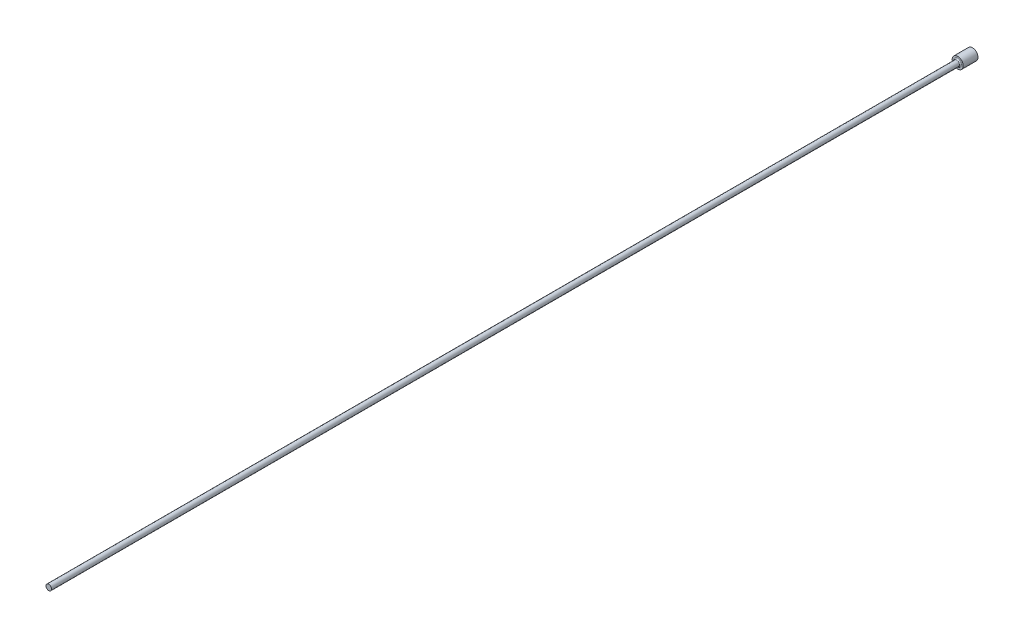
ISO-10303-21;
HEADER;
FILE_DESCRIPTION(('STEP AP214'),'2;1');
FILE_NAME('part.step','',(''),(''),'','','');
FILE_SCHEMA(('AUTOMOTIVE_DESIGN { 1 0 10303 214 1 1 1 1 }'));
ENDSEC;
DATA;
#1=APPLICATION_CONTEXT('core data for automotive mechanical design processes');
#2=APPLICATION_PROTOCOL_DEFINITION('international standard','automotive_design',2000,#1);
#3=PRODUCT_CONTEXT('',#1,'mechanical');
#4=PRODUCT('Part','Part','',(#3));
#5=PRODUCT_RELATED_PRODUCT_CATEGORY('part','',(#4));
#6=PRODUCT_DEFINITION_FORMATION('','',#4);
#7=PRODUCT_DEFINITION_CONTEXT('part definition',#1,'design');
#8=PRODUCT_DEFINITION('design','',#6,#7);
#9=PRODUCT_DEFINITION_SHAPE('','',#8);
#10=(LENGTH_UNIT() NAMED_UNIT(*) SI_UNIT(.MILLI.,.METRE.));
#11=(NAMED_UNIT(*) PLANE_ANGLE_UNIT() SI_UNIT($,.RADIAN.));
#12=(NAMED_UNIT(*) SI_UNIT($,.STERADIAN.) SOLID_ANGLE_UNIT());
#13=UNCERTAINTY_MEASURE_WITH_UNIT(LENGTH_MEASURE(1.E-05),#10,'distance_accuracy_value','');
#14=(GEOMETRIC_REPRESENTATION_CONTEXT(3) GLOBAL_UNCERTAINTY_ASSIGNED_CONTEXT((#13)) GLOBAL_UNIT_ASSIGNED_CONTEXT((#10,
#11,#12)) REPRESENTATION_CONTEXT('',''));
#15=CARTESIAN_POINT('',(0.,0.,0.));
#16=DIRECTION('',(0.,0.,1.));
#17=DIRECTION('',(1.,0.,0.));
#18=AXIS2_PLACEMENT_3D('',#15,#16,#17);
#19=CARTESIAN_POINT('',(1.5,0.,4.));
#20=DIRECTION('',(0.,0.,-1.));
#21=DIRECTION('',(-1.,0.,0.));
#22=AXIS2_PLACEMENT_3D('',#19,#20,#21);
#23=PLANE('',#22);
#24=CARTESIAN_POINT('',(0.,0.,4.));
#25=DIRECTION('',(0.,0.,-1.));
#26=DIRECTION('',(-1.,0.,0.));
#27=AXIS2_PLACEMENT_3D('',#24,#25,#26);
#28=CIRCLE('',#27,1.05000000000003);
#29=CARTESIAN_POINT('',(-1.05000000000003,0.,4.));
#30=VERTEX_POINT('',#29);
#31=EDGE_CURVE('E40',#30,#30,#28,.T.);
#32=ORIENTED_EDGE('',*,*,#31,.T.);
#33=EDGE_LOOP('',(#32));
#34=FACE_BOUND('',#33,.T.);
#35=CARTESIAN_POINT('',(0.,0.,4.));
#36=DIRECTION('',(0.,0.,-1.));
#37=DIRECTION('',(-1.,0.,0.));
#38=AXIS2_PLACEMENT_3D('',#35,#36,#37);
#39=CIRCLE('',#38,1.5);
#40=CARTESIAN_POINT('',(-1.5,0.,4.));
#41=VERTEX_POINT('',#40);
#42=EDGE_CURVE('E44',#41,#41,#39,.T.);
#43=ORIENTED_EDGE('',*,*,#42,.F.);
#44=EDGE_LOOP('',(#43));
#45=FACE_BOUND('',#44,.T.);
#46=ADVANCED_FACE('F33',(#34,#45),#23,.F.);
#47=CARTESIAN_POINT('',(0.,0.,-9.03322817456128));
#48=DIRECTION('',(0.,0.,-1.));
#49=DIRECTION('',(-1.,0.,0.));
#50=AXIS2_PLACEMENT_3D('',#47,#48,#49);
#51=CYLINDRICAL_SURFACE('',#50,1.5);
#52=CARTESIAN_POINT('',(0.,0.,0.));
#53=DIRECTION('',(0.,0.,-1.));
#54=DIRECTION('',(-1.,0.,0.));
#55=AXIS2_PLACEMENT_3D('',#52,#53,#54);
#56=CIRCLE('',#55,1.5);
#57=CARTESIAN_POINT('',(-1.5,0.,0.));
#58=VERTEX_POINT('',#57);
#59=EDGE_CURVE('E48',#58,#58,#56,.T.);
#60=ORIENTED_EDGE('',*,*,#59,.F.);
#61=EDGE_LOOP('',(#60));
#62=FACE_BOUND('',#61,.T.);
#63=ORIENTED_EDGE('',*,*,#42,.T.);
#64=EDGE_LOOP('',(#63));
#65=FACE_BOUND('',#64,.T.);
#66=ADVANCED_FACE('F68',(#62,#65),#51,.T.);
#67=CARTESIAN_POINT('',(0.,0.,0.));
#68=DIRECTION('',(0.,0.,1.));
#69=DIRECTION('',(1.,0.,0.));
#70=AXIS2_PLACEMENT_3D('',#67,#68,#69);
#71=PLANE('',#70);
#72=ORIENTED_EDGE('',*,*,#59,.T.);
#73=EDGE_LOOP('',(#72));
#74=FACE_BOUND('',#73,.T.);
#75=ADVANCED_FACE('F61',(#74),#71,.F.);
#76=CARTESIAN_POINT('',(0.,0.,250.));
#77=DIRECTION('',(0.,0.,-1.));
#78=DIRECTION('',(-1.,0.,0.));
#79=AXIS2_PLACEMENT_3D('',#76,#77,#78);
#80=PLANE('',#79);
#81=CARTESIAN_POINT('',(0.,0.,250.));
#82=DIRECTION('',(0.,0.,-1.));
#83=DIRECTION('',(-1.,0.,0.));
#84=AXIS2_PLACEMENT_3D('',#81,#82,#83);
#85=CIRCLE('',#84,0.750000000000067);
#86=CARTESIAN_POINT('',(-0.750000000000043,0.,250.));
#87=VERTEX_POINT('',#86);
#88=EDGE_CURVE('E53',#87,#87,#85,.T.);
#89=ORIENTED_EDGE('',*,*,#88,.F.);
#90=EDGE_LOOP('',(#89));
#91=FACE_BOUND('',#90,.T.);
#92=ADVANCED_FACE('F59',(#91),#80,.F.);
#93=CARTESIAN_POINT('',(0.,0.,-9.03322817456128));
#94=DIRECTION('',(0.,0.,-1.));
#95=DIRECTION('',(-1.,0.,0.));
#96=AXIS2_PLACEMENT_3D('',#93,#94,#95);
#97=CYLINDRICAL_SURFACE('',#96,0.750000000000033);
#98=CARTESIAN_POINT('',(0.,0.,4.3));
#99=DIRECTION('',(0.,0.,-1.));
#100=DIRECTION('',(-1.,0.,0.));
#101=AXIS2_PLACEMENT_3D('',#98,#99,#100);
#102=CIRCLE('',#101,0.750000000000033);
#103=CARTESIAN_POINT('',(-0.750000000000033,0.,4.3));
#104=VERTEX_POINT('',#103);
#105=EDGE_CURVE('E10',#104,#104,#102,.F.);
#106=ORIENTED_EDGE('',*,*,#105,.T.);
#107=EDGE_LOOP('',(#106));
#108=FACE_BOUND('',#107,.T.);
#109=ORIENTED_EDGE('',*,*,#88,.T.);
#110=EDGE_LOOP('',(#109));
#111=FACE_BOUND('',#110,.T.);
#112=ADVANCED_FACE('F57',(#108,#111),#97,.T.);
#113=CARTESIAN_POINT('',(0.,0.,4.3));
#114=DIRECTION('',(0.,0.,-1.));
#115=DIRECTION('',(-1.,0.,0.));
#116=AXIS2_PLACEMENT_3D('',#113,#114,#115);
#117=TOROIDAL_SURFACE('',#116,1.05000000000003,0.3);
#118=ORIENTED_EDGE('',*,*,#105,.F.);
#119=EDGE_LOOP('',(#118));
#120=FACE_BOUND('',#119,.T.);
#121=ORIENTED_EDGE('',*,*,#31,.F.);
#122=EDGE_LOOP('',(#121));
#123=FACE_BOUND('',#122,.T.);
#124=ADVANCED_FACE('F35',(#120,#123),#117,.F.);
#125=CLOSED_SHELL('',(#46,#66,#75,#92,#112,#124));
#126=MANIFOLD_SOLID_BREP('B2',#125);
#127=ADVANCED_BREP_SHAPE_REPRESENTATION('',(#18,#126),#14);
#128=SHAPE_DEFINITION_REPRESENTATION(#9,#127);
ENDSEC;
END-ISO-10303-21;
